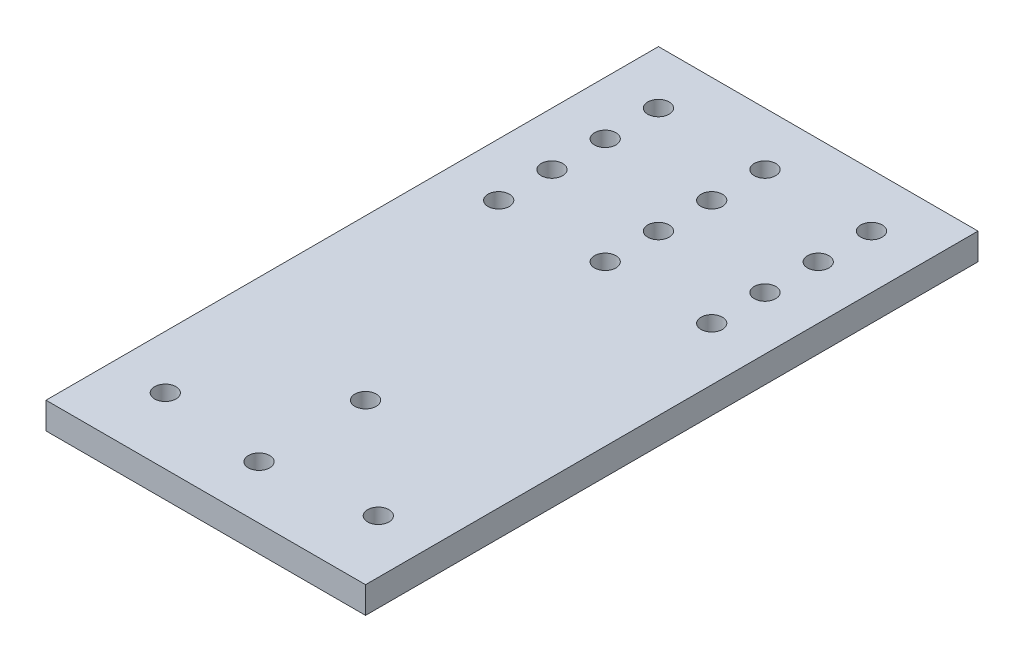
from build123d import *

# Parameters (mm, degrees)
SKETCH1_W               = 76.2
SKETCH1_H               = 146.05
BOSS_EXTRUDE1_DEPTH     = 6.35
F_1_4_20_TAPPED_HOLE1_D = 5.1054


with BuildPart() as part:
    # Sketch1 → Boss-Extrude1 (new body)
    with BuildSketch(Plane(origin=(0, 0, 0), x_dir=(1, 0, 0), z_dir=(0, 1, 0))):
        Rectangle(SKETCH1_W, SKETCH1_H)
    extrude(amount=BOSS_EXTRUDE1_DEPTH)

    # 1_4-20 Tapped Hole1 (through all)
    with Locations(Plane(origin=(0, 6.35, 0), x_dir=(1, 0, 0), z_dir=(0, 1, 0))):
        with Locations((0, -60.325), (0, -34.925), (-25.4, -57.277), (25.4, -57.277), (0, 22.225), (0, 34.925), (0, 47.625), (0, 60.325), (-25.4, 60.325), (-25.4, 47.625), (-25.4, 34.925), (-25.4, 22.225), (25.4, 22.225), (25.4, 34.925), (25.4, 47.625), (25.4, 60.325)):
            Hole(F_1_4_20_TAPPED_HOLE1_D / 2)


solid = part.part
